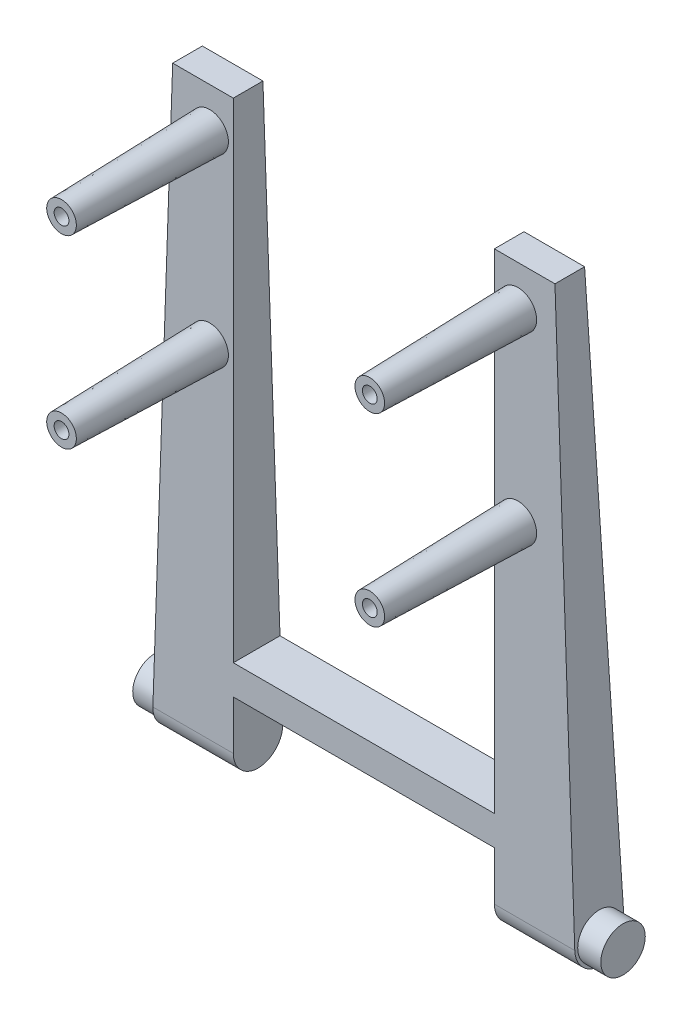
ISO-10303-21;
HEADER;
FILE_DESCRIPTION(('STEP AP214'),'2;1');
FILE_NAME('part.step','',(''),(''),'','','');
FILE_SCHEMA(('AUTOMOTIVE_DESIGN { 1 0 10303 214 1 1 1 1 }'));
ENDSEC;
DATA;
#1=APPLICATION_CONTEXT('core data for automotive mechanical design processes');
#2=APPLICATION_PROTOCOL_DEFINITION('international standard','automotive_design',2000,#1);
#3=PRODUCT_CONTEXT('',#1,'mechanical');
#4=PRODUCT('Part','Part','',(#3));
#5=PRODUCT_RELATED_PRODUCT_CATEGORY('part','',(#4));
#6=PRODUCT_DEFINITION_FORMATION('','',#4);
#7=PRODUCT_DEFINITION_CONTEXT('part definition',#1,'design');
#8=PRODUCT_DEFINITION('design','',#6,#7);
#9=PRODUCT_DEFINITION_SHAPE('','',#8);
#10=(LENGTH_UNIT() NAMED_UNIT(*) SI_UNIT(.MILLI.,.METRE.));
#11=(NAMED_UNIT(*) PLANE_ANGLE_UNIT() SI_UNIT($,.RADIAN.));
#12=(NAMED_UNIT(*) SI_UNIT($,.STERADIAN.) SOLID_ANGLE_UNIT());
#13=UNCERTAINTY_MEASURE_WITH_UNIT(LENGTH_MEASURE(1.E-05),#10,'distance_accuracy_value','');
#14=(GEOMETRIC_REPRESENTATION_CONTEXT(3) GLOBAL_UNCERTAINTY_ASSIGNED_CONTEXT((#13)) GLOBAL_UNIT_ASSIGNED_CONTEXT((#10,
#11,#12)) REPRESENTATION_CONTEXT('',''));
#15=CARTESIAN_POINT('',(0.,0.,0.));
#16=DIRECTION('',(0.,0.,1.));
#17=DIRECTION('',(1.,0.,0.));
#18=AXIS2_PLACEMENT_3D('',#15,#16,#17);
#19=CARTESIAN_POINT('',(-8.80937578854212,14.7347085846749,-24.1947583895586));
#20=DIRECTION('',(-1.,0.,0.));
#21=DIRECTION('',(0.,0.,1.));
#22=AXIS2_PLACEMENT_3D('',#19,#20,#21);
#23=PLANE('',#22);
#24=CARTESIAN_POINT('',(-8.80937578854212,19.95,-23.8947583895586));
#25=DIRECTION('',(-1.,0.,0.));
#26=DIRECTION('',(0.,0.,1.));
#27=AXIS2_PLACEMENT_3D('',#24,#25,#26);
#28=CIRCLE('',#27,1.7);
#29=CARTESIAN_POINT('',(-8.80937578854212,19.95,-22.1947583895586));
#30=VERTEX_POINT('',#29);
#31=CARTESIAN_POINT('',(-8.80937578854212,18.2502971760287,-23.8629730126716));
#32=VERTEX_POINT('',#31);
#33=EDGE_CURVE('E323',#30,#32,#28,.F.);
#34=ORIENTED_EDGE('',*,*,#33,.T.);
#35=CARTESIAN_POINT('',(-8.80937578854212,19.95,-23.8311876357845));
#36=DIRECTION('',(-1.,0.,0.));
#37=DIRECTION('',(0.,0.,1.));
#38=AXIS2_PLACEMENT_3D('',#35,#36,#37);
#39=CIRCLE('',#38,1.7);
#40=CARTESIAN_POINT('',(-8.80937578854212,20.0093291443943,-25.530152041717));
#41=VERTEX_POINT('',#40);
#42=EDGE_CURVE('E326',#32,#41,#39,.F.);
#43=ORIENTED_EDGE('',*,*,#42,.T.);
#44=DIRECTION('',(0.,0.999390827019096,0.034899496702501));
#45=VECTOR('',#44,1.);
#46=CARTESIAN_POINT('',(-8.80937578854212,58.25,-24.1947583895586));
#47=LINE('',#46,#45);
#48=CARTESIAN_POINT('',(-8.80937578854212,23.25,-25.4169853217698));
#49=VERTEX_POINT('',#48);
#50=EDGE_CURVE('E192',#49,#41,#47,.F.);
#51=ORIENTED_EDGE('',*,*,#50,.F.);
#52=DIRECTION('',(0.,0.,-1.));
#53=VECTOR('',#52,1.);
#54=CARTESIAN_POINT('',(-8.80937578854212,23.25,-22.1947583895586));
#55=LINE('',#54,#53);
#56=CARTESIAN_POINT('',(-8.80937578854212,23.25,-22.1947583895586));
#57=VERTEX_POINT('',#56);
#58=EDGE_CURVE('E167',#57,#49,#55,.T.);
#59=ORIENTED_EDGE('',*,*,#58,.F.);
#60=DIRECTION('',(0.,1.,0.));
#61=VECTOR('',#60,1.);
#62=CARTESIAN_POINT('',(-8.80937578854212,14.7347085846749,-22.1947583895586));
#63=LINE('',#62,#61);
#64=EDGE_CURVE('E149',#30,#57,#63,.T.);
#65=ORIENTED_EDGE('',*,*,#64,.F.);
#66=EDGE_LOOP('',(#34,#43,#51,#59,#65));
#67=FACE_BOUND('',#66,.T.);
#68=ADVANCED_FACE('F39',(#67),#23,.F.);
#69=DIRECTION('',(0.,0.,1.));
#70=VECTOR('',#69,1.);
#71=CARTESIAN_POINT('',(-8.80937578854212,25.2480319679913,-25.3472125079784));
#72=LINE('',#71,#70);
#73=CARTESIAN_POINT('',(-8.80937578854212,25.2480319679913,-25.3472125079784));
#74=VERTEX_POINT('',#73);
#75=CARTESIAN_POINT('',(-8.80937578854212,25.2480319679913,-22.1947583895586));
#76=VERTEX_POINT('',#75);
#77=EDGE_CURVE('E142',#74,#76,#72,.T.);
#78=ORIENTED_EDGE('',*,*,#77,.F.);
#79=CARTESIAN_POINT('',(-8.80937578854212,58.25,-24.1947583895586));
#80=VERTEX_POINT('',#79);
#81=EDGE_CURVE('E193',#80,#74,#47,.F.);
#82=ORIENTED_EDGE('',*,*,#81,.F.);
#83=DIRECTION('',(0.,0.,-1.));
#84=VECTOR('',#83,1.);
#85=CARTESIAN_POINT('',(-8.80937578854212,58.25,0.));
#86=LINE('',#85,#84);
#87=CARTESIAN_POINT('',(-8.80937578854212,58.25,-22.1947583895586));
#88=VERTEX_POINT('',#87);
#89=EDGE_CURVE('E145',#88,#80,#86,.T.);
#90=ORIENTED_EDGE('',*,*,#89,.F.);
#91=EDGE_CURVE('E138',#76,#88,#63,.T.);
#92=ORIENTED_EDGE('',*,*,#91,.F.);
#93=EDGE_LOOP('',(#78,#82,#90,#92));
#94=FACE_BOUND('',#93,.T.);
#95=ADVANCED_FACE('F140',(#94),#23,.F.);
#96=CARTESIAN_POINT('',(8.80937578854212,14.7347085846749,-24.1947583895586));
#97=DIRECTION('',(-1.,0.,0.));
#98=DIRECTION('',(0.,0.,1.));
#99=AXIS2_PLACEMENT_3D('',#96,#97,#98);
#100=PLANE('',#99);
#101=DIRECTION('',(0.,0.999390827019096,0.034899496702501));
#102=VECTOR('',#101,1.);
#103=CARTESIAN_POINT('',(8.80937578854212,58.25,-24.1947583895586));
#104=LINE('',#103,#102);
#105=CARTESIAN_POINT('',(8.80937578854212,20.0093291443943,-25.530152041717));
#106=VERTEX_POINT('',#105);
#107=CARTESIAN_POINT('',(8.80937578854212,23.25,-25.4169853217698));
#108=VERTEX_POINT('',#107);
#109=EDGE_CURVE('E150',#106,#108,#104,.T.);
#110=ORIENTED_EDGE('',*,*,#109,.F.);
#111=CARTESIAN_POINT('',(8.80937578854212,19.95,-23.8311876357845));
#112=DIRECTION('',(-1.,0.,0.));
#113=DIRECTION('',(0.,0.,1.));
#114=AXIS2_PLACEMENT_3D('',#111,#112,#113);
#115=CIRCLE('',#114,1.7);
#116=CARTESIAN_POINT('',(8.80937578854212,18.2502971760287,-23.8629730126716));
#117=VERTEX_POINT('',#116);
#118=EDGE_CURVE('E55',#106,#117,#115,.T.);
#119=ORIENTED_EDGE('',*,*,#118,.T.);
#120=CARTESIAN_POINT('',(8.80937578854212,19.95,-23.8947583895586));
#121=DIRECTION('',(-1.,0.,0.));
#122=DIRECTION('',(0.,0.,1.));
#123=AXIS2_PLACEMENT_3D('',#120,#121,#122);
#124=CIRCLE('',#123,1.7);
#125=CARTESIAN_POINT('',(8.80937578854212,19.95,-22.1947583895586));
#126=VERTEX_POINT('',#125);
#127=EDGE_CURVE('E59',#117,#126,#124,.T.);
#128=ORIENTED_EDGE('',*,*,#127,.T.);
#129=DIRECTION('',(0.,1.,0.));
#130=VECTOR('',#129,1.);
#131=CARTESIAN_POINT('',(8.80937578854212,14.7347085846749,-22.1947583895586));
#132=LINE('',#131,#130);
#133=CARTESIAN_POINT('',(8.80937578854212,23.25,-22.1947583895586));
#134=VERTEX_POINT('',#133);
#135=EDGE_CURVE('E185',#126,#134,#132,.T.);
#136=ORIENTED_EDGE('',*,*,#135,.T.);
#137=DIRECTION('',(0.,0.,-1.));
#138=VECTOR('',#137,1.);
#139=CARTESIAN_POINT('',(8.80937578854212,23.25,-24.1947583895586));
#140=LINE('',#139,#138);
#141=EDGE_CURVE('E305',#134,#108,#140,.T.);
#142=ORIENTED_EDGE('',*,*,#141,.T.);
#143=EDGE_LOOP('',(#110,#119,#128,#136,#142));
#144=FACE_BOUND('',#143,.T.);
#145=ADVANCED_FACE('F378',(#144),#100,.T.);
#146=CARTESIAN_POINT('',(8.80937578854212,25.2480319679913,-25.3472125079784));
#147=VERTEX_POINT('',#146);
#148=CARTESIAN_POINT('',(8.80937578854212,58.25,-24.1947583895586));
#149=VERTEX_POINT('',#148);
#150=EDGE_CURVE('E188',#147,#149,#104,.T.);
#151=ORIENTED_EDGE('',*,*,#150,.F.);
#152=DIRECTION('',(0.,0.,1.));
#153=VECTOR('',#152,1.);
#154=CARTESIAN_POINT('',(8.80937578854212,25.2480319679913,-24.1947583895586));
#155=LINE('',#154,#153);
#156=CARTESIAN_POINT('',(8.80937578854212,25.2480319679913,-22.1947583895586));
#157=VERTEX_POINT('',#156);
#158=EDGE_CURVE('E302',#147,#157,#155,.T.);
#159=ORIENTED_EDGE('',*,*,#158,.T.);
#160=CARTESIAN_POINT('',(8.80937578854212,58.25,-22.1947583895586));
#161=VERTEX_POINT('',#160);
#162=EDGE_CURVE('E157',#157,#161,#132,.T.);
#163=ORIENTED_EDGE('',*,*,#162,.T.);
#164=DIRECTION('',(0.,0.,-1.));
#165=VECTOR('',#164,1.);
#166=CARTESIAN_POINT('',(8.80937578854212,58.25,0.));
#167=LINE('',#166,#165);
#168=EDGE_CURVE('E298',#161,#149,#167,.T.);
#169=ORIENTED_EDGE('',*,*,#168,.T.);
#170=EDGE_LOOP('',(#151,#159,#163,#169));
#171=FACE_BOUND('',#170,.T.);
#172=ADVANCED_FACE('F396',(#171),#100,.T.);
#173=CARTESIAN_POINT('',(0.,58.25,0.));
#174=DIRECTION('',(0.,-1.,0.));
#175=DIRECTION('',(0.,0.,-1.));
#176=AXIS2_PLACEMENT_3D('',#173,#174,#175);
#177=PLANE('',#176);
#178=ORIENTED_EDGE('',*,*,#168,.F.);
#179=DIRECTION('',(-1.,0.,0.));
#180=VECTOR('',#179,1.);
#181=CARTESIAN_POINT('',(12.8992245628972,58.25,-22.1947583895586));
#182=LINE('',#181,#180);
#183=CARTESIAN_POINT('',(12.8992245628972,58.25,-22.1947583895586));
#184=VERTEX_POINT('',#183);
#185=EDGE_CURVE('E227',#184,#161,#182,.T.);
#186=ORIENTED_EDGE('',*,*,#185,.F.);
#187=DIRECTION('',(0.,0.,1.));
#188=VECTOR('',#187,1.);
#189=CARTESIAN_POINT('',(12.8992245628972,58.25,-22.1947583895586));
#190=LINE('',#189,#188);
#191=CARTESIAN_POINT('',(12.8992245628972,58.25,-24.1947583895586));
#192=VERTEX_POINT('',#191);
#193=EDGE_CURVE('E220',#192,#184,#190,.T.);
#194=ORIENTED_EDGE('',*,*,#193,.F.);
#195=DIRECTION('',(1.,0.,0.));
#196=VECTOR('',#195,1.);
#197=CARTESIAN_POINT('',(12.8992245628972,58.25,-24.1947583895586));
#198=LINE('',#197,#196);
#199=EDGE_CURVE('E224',#149,#192,#198,.T.);
#200=ORIENTED_EDGE('',*,*,#199,.F.);
#201=EDGE_LOOP('',(#178,#186,#194,#200));
#202=FACE_BOUND('',#201,.T.);
#203=ADVANCED_FACE('F400',(#202),#177,.F.);
#204=CARTESIAN_POINT('',(-12.8992245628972,58.25,-22.1947583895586));
#205=DIRECTION('',(0.,0.,-1.));
#206=DIRECTION('',(-1.,0.,0.));
#207=AXIS2_PLACEMENT_3D('',#204,#205,#206);
#208=PLANE('',#207);
#209=ORIENTED_EDGE('',*,*,#135,.F.);
#210=DIRECTION('',(-1.,0.,0.));
#211=VECTOR('',#210,1.);
#212=CARTESIAN_POINT('',(-12.8992245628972,19.95,-22.1947583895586));
#213=LINE('',#212,#211);
#214=CARTESIAN_POINT('',(14.2366900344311,19.95,-22.1947583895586));
#215=VERTEX_POINT('',#214);
#216=EDGE_CURVE('E342',#126,#215,#213,.F.);
#217=ORIENTED_EDGE('',*,*,#216,.T.);
#218=DIRECTION('',(0.034899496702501,-0.999390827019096,0.));
#219=VECTOR('',#218,1.);
#220=CARTESIAN_POINT('',(12.8992245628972,58.25,-22.1947583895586));
#221=LINE('',#220,#219);
#222=EDGE_CURVE('E230',#184,#215,#221,.T.);
#223=ORIENTED_EDGE('',*,*,#222,.F.);
#224=ORIENTED_EDGE('',*,*,#185,.T.);
#225=ORIENTED_EDGE('',*,*,#162,.F.);
#226=DIRECTION('',(-1.,0.,0.));
#227=VECTOR('',#226,1.);
#228=CARTESIAN_POINT('',(9.19062421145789,25.2480319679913,-22.1947583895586));
#229=LINE('',#228,#227);
#230=EDGE_CURVE('E153',#157,#76,#229,.T.);
#231=ORIENTED_EDGE('',*,*,#230,.T.);
#232=ORIENTED_EDGE('',*,*,#91,.T.);
#233=DIRECTION('',(1.,0.,0.));
#234=VECTOR('',#233,1.);
#235=CARTESIAN_POINT('',(-12.8992245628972,58.25,-22.1947583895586));
#236=LINE('',#235,#234);
#237=CARTESIAN_POINT('',(-12.8992245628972,58.25,-22.1947583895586));
#238=VERTEX_POINT('',#237);
#239=EDGE_CURVE('E260',#238,#88,#236,.T.);
#240=ORIENTED_EDGE('',*,*,#239,.F.);
#241=DIRECTION('',(0.034899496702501,0.999390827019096,0.));
#242=VECTOR('',#241,1.);
#243=CARTESIAN_POINT('',(-12.8992245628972,58.25,-22.1947583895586));
#244=LINE('',#243,#242);
#245=CARTESIAN_POINT('',(-14.2366900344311,19.95,-22.1947583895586));
#246=VERTEX_POINT('',#245);
#247=EDGE_CURVE('E270',#238,#246,#244,.F.);
#248=ORIENTED_EDGE('',*,*,#247,.T.);
#249=DIRECTION('',(1.,0.,0.));
#250=VECTOR('',#249,1.);
#251=CARTESIAN_POINT('',(-12.8992245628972,19.95,-22.1947583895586));
#252=LINE('',#251,#250);
#253=EDGE_CURVE('E339',#246,#30,#252,.T.);
#254=ORIENTED_EDGE('',*,*,#253,.T.);
#255=ORIENTED_EDGE('',*,*,#64,.T.);
#256=DIRECTION('',(-1.,0.,0.));
#257=VECTOR('',#256,1.);
#258=CARTESIAN_POINT('',(9.19062421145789,23.25,-22.1947583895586));
#259=LINE('',#258,#257);
#260=EDGE_CURVE('E181',#134,#57,#259,.T.);
#261=ORIENTED_EDGE('',*,*,#260,.F.);
#262=EDGE_LOOP('',(#209,#217,#223,#224,#225,#231,#232,#240,#248,#254,#255,#261));
#263=FACE_BOUND('',#262,.T.);
#264=CARTESIAN_POINT('',(-10.4018583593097,43.05,-22.1947583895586));
#265=DIRECTION('',(0.,0.,-1.));
#266=DIRECTION('',(-1.,0.,0.));
#267=AXIS2_PLACEMENT_3D('',#264,#265,#266);
#268=CIRCLE('',#267,1.26185921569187);
#269=CARTESIAN_POINT('',(-11.6637175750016,43.05,-22.1947583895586));
#270=VERTEX_POINT('',#269);
#271=EDGE_CURVE('E284',#270,#270,#268,.F.);
#272=ORIENTED_EDGE('',*,*,#271,.F.);
#273=EDGE_LOOP('',(#272));
#274=FACE_BOUND('',#273,.T.);
#275=CARTESIAN_POINT('',(-10.4018583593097,55.5248466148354,-22.1947583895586));
#276=DIRECTION('',(0.,0.,-1.));
#277=DIRECTION('',(-1.,0.,0.));
#278=AXIS2_PLACEMENT_3D('',#275,#276,#277);
#279=CIRCLE('',#278,1.26185921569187);
#280=CARTESIAN_POINT('',(-11.6637175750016,55.5248466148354,-22.1947583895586));
#281=VERTEX_POINT('',#280);
#282=EDGE_CURVE('E274',#281,#281,#279,.F.);
#283=ORIENTED_EDGE('',*,*,#282,.F.);
#284=EDGE_LOOP('',(#283));
#285=FACE_BOUND('',#284,.T.);
#286=CARTESIAN_POINT('',(10.4018583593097,43.05,-22.1947583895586));
#287=DIRECTION('',(0.,0.,1.));
#288=DIRECTION('',(1.,0.,0.));
#289=AXIS2_PLACEMENT_3D('',#286,#287,#288);
#290=CIRCLE('',#289,1.26185921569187);
#291=CARTESIAN_POINT('',(11.6637175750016,43.05,-22.1947583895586));
#292=VERTEX_POINT('',#291);
#293=EDGE_CURVE('E289',#292,#292,#290,.T.);
#294=ORIENTED_EDGE('',*,*,#293,.F.);
#295=EDGE_LOOP('',(#294));
#296=FACE_BOUND('',#295,.T.);
#297=CARTESIAN_POINT('',(10.4018583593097,55.5248466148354,-22.1947583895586));
#298=DIRECTION('',(0.,0.,1.));
#299=DIRECTION('',(1.,0.,0.));
#300=AXIS2_PLACEMENT_3D('',#297,#298,#299);
#301=CIRCLE('',#300,1.26185921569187);
#302=CARTESIAN_POINT('',(11.6637175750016,55.5248466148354,-22.1947583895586));
#303=VERTEX_POINT('',#302);
#304=EDGE_CURVE('E285',#303,#303,#301,.T.);
#305=ORIENTED_EDGE('',*,*,#304,.F.);
#306=EDGE_LOOP('',(#305));
#307=FACE_BOUND('',#306,.T.);
#308=ADVANCED_FACE('F154',(#263,#274,#285,#296,#307),#208,.F.);
#309=CARTESIAN_POINT('',(-12.8992245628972,58.25,-24.1947583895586));
#310=DIRECTION('',(0.,0.034899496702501,-0.999390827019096));
#311=DIRECTION('',(0.,0.999390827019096,0.034899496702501));
#312=AXIS2_PLACEMENT_3D('',#309,#310,#311);
#313=PLANE('',#312);
#314=ORIENTED_EDGE('',*,*,#50,.T.);
#315=DIRECTION('',(-1.,0.,0.));
#316=VECTOR('',#315,1.);
#317=CARTESIAN_POINT('',(-12.8992245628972,20.0093291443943,-25.530152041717));
#318=LINE('',#317,#316);
#319=CARTESIAN_POINT('',(-14.2346182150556,20.0093291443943,-25.530152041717));
#320=VERTEX_POINT('',#319);
#321=EDGE_CURVE('E313',#41,#320,#318,.T.);
#322=ORIENTED_EDGE('',*,*,#321,.T.);
#323=DIRECTION('',(-0.0348782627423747,-0.998782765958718,-0.0348782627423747));
#324=VECTOR('',#323,1.);
#325=CARTESIAN_POINT('',(-12.8967915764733,58.3196716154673,-24.1923254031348));
#326=LINE('',#325,#324);
#327=CARTESIAN_POINT('',(-12.8992245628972,58.25,-24.1947583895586));
#328=VERTEX_POINT('',#327);
#329=EDGE_CURVE('E266',#328,#320,#326,.T.);
#330=ORIENTED_EDGE('',*,*,#329,.F.);
#331=DIRECTION('',(-1.,0.,0.));
#332=VECTOR('',#331,1.);
#333=CARTESIAN_POINT('',(-12.8992245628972,58.25,-24.1947583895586));
#334=LINE('',#333,#332);
#335=EDGE_CURVE('E263',#80,#328,#334,.T.);
#336=ORIENTED_EDGE('',*,*,#335,.F.);
#337=ORIENTED_EDGE('',*,*,#81,.T.);
#338=DIRECTION('',(-1.,0.,0.));
#339=VECTOR('',#338,1.);
#340=CARTESIAN_POINT('',(9.19062421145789,25.2480319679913,-25.3472125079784));
#341=LINE('',#340,#339);
#342=EDGE_CURVE('E161',#147,#74,#341,.T.);
#343=ORIENTED_EDGE('',*,*,#342,.F.);
#344=ORIENTED_EDGE('',*,*,#150,.T.);
#345=ORIENTED_EDGE('',*,*,#199,.T.);
#346=DIRECTION('',(0.0348782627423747,-0.998782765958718,-0.0348782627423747));
#347=VECTOR('',#346,1.);
#348=CARTESIAN_POINT('',(12.8992245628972,58.25,-24.1947583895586));
#349=LINE('',#348,#347);
#350=CARTESIAN_POINT('',(14.2346182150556,20.0093291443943,-25.530152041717));
#351=VERTEX_POINT('',#350);
#352=EDGE_CURVE('E248',#192,#351,#349,.T.);
#353=ORIENTED_EDGE('',*,*,#352,.T.);
#354=DIRECTION('',(1.,0.,0.));
#355=VECTOR('',#354,1.);
#356=CARTESIAN_POINT('',(-12.8992245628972,20.0093291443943,-25.530152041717));
#357=LINE('',#356,#355);
#358=EDGE_CURVE('E309',#351,#106,#357,.F.);
#359=ORIENTED_EDGE('',*,*,#358,.T.);
#360=ORIENTED_EDGE('',*,*,#109,.T.);
#361=DIRECTION('',(-1.,0.,0.));
#362=VECTOR('',#361,1.);
#363=CARTESIAN_POINT('',(9.19062421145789,23.25,-25.4169853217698));
#364=LINE('',#363,#362);
#365=EDGE_CURVE('E177',#108,#49,#364,.T.);
#366=ORIENTED_EDGE('',*,*,#365,.T.);
#367=EDGE_LOOP('',(#314,#322,#330,#336,#337,#343,#344,#345,#353,#359,#360,#366));
#368=FACE_BOUND('',#367,.T.);
#369=ADVANCED_FACE('F376',(#368),#313,.T.);
#370=CARTESIAN_POINT('',(-12.8992245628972,58.25,-22.1947583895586));
#371=DIRECTION('',(-0.999390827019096,0.034899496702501,0.));
#372=DIRECTION('',(-0.034899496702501,-0.999390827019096,0.));
#373=AXIS2_PLACEMENT_3D('',#370,#371,#372);
#374=PLANE('',#373);
#375=CARTESIAN_POINT('',(-14.2366900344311,19.95,-23.8931737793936));
#376=DIRECTION('',(-0.999390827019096,0.034899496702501,0.));
#377=DIRECTION('',(-0.034899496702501,-0.999390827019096,0.));
#378=AXIS2_PLACEMENT_3D('',#375,#376,#377);
#379=ELLIPSE('',#378,1.50035643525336,1.49944245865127);
#380=CARTESIAN_POINT('',(-14.2890517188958,18.4505575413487,-23.8931737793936));
#381=VERTEX_POINT('',#380);
#382=EDGE_CURVE('E11',#381,#381,#379,.T.);
#383=ORIENTED_EDGE('',*,*,#382,.F.);
#384=EDGE_LOOP('',(#383));
#385=FACE_BOUND('',#384,.T.);
#386=ORIENTED_EDGE('',*,*,#329,.T.);
#387=CARTESIAN_POINT('',(-14.2366900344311,19.95,-23.8311876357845));
#388=DIRECTION('',(-0.999390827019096,0.034899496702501,0.));
#389=DIRECTION('',(0.034899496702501,0.999390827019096,0.));
#390=AXIS2_PLACEMENT_3D('',#387,#388,#389);
#391=ELLIPSE('',#390,1.701036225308,1.7);
#392=CARTESIAN_POINT('',(-14.2960449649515,18.2502971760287,-23.8629730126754));
#393=VERTEX_POINT('',#392);
#394=EDGE_CURVE('E320',#320,#393,#391,.T.);
#395=ORIENTED_EDGE('',*,*,#394,.T.);
#396=CARTESIAN_POINT('',(-14.2366900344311,19.95,-23.8947583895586));
#397=DIRECTION('',(-0.999390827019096,0.034899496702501,0.));
#398=DIRECTION('',(0.034899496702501,0.999390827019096,0.));
#399=AXIS2_PLACEMENT_3D('',#396,#397,#398);
#400=ELLIPSE('',#399,1.701036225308,1.7);
#401=EDGE_CURVE('E317',#393,#246,#400,.T.);
#402=ORIENTED_EDGE('',*,*,#401,.T.);
#403=ORIENTED_EDGE('',*,*,#247,.F.);
#404=DIRECTION('',(0.,0.,1.));
#405=VECTOR('',#404,1.);
#406=CARTESIAN_POINT('',(-12.8992245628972,58.25,-22.1947583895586));
#407=LINE('',#406,#405);
#408=EDGE_CURVE('E256',#328,#238,#407,.T.);
#409=ORIENTED_EDGE('',*,*,#408,.F.);
#410=EDGE_LOOP('',(#386,#395,#402,#403,#409));
#411=FACE_BOUND('',#410,.T.);
#412=ADVANCED_FACE('F415',(#385,#411),#374,.T.);
#413=CARTESIAN_POINT('',(0.,58.25,0.));
#414=DIRECTION('',(0.,-1.,0.));
#415=DIRECTION('',(0.,0.,-1.));
#416=AXIS2_PLACEMENT_3D('',#413,#414,#415);
#417=PLANE('',#416);
#418=ORIENTED_EDGE('',*,*,#239,.T.);
#419=ORIENTED_EDGE('',*,*,#89,.T.);
#420=ORIENTED_EDGE('',*,*,#335,.T.);
#421=ORIENTED_EDGE('',*,*,#408,.T.);
#422=EDGE_LOOP('',(#418,#419,#420,#421));
#423=FACE_BOUND('',#422,.T.);
#424=ADVANCED_FACE('F405',(#423),#417,.F.);
#425=CARTESIAN_POINT('',(-10.4018583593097,55.5248466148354,-12.1947583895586));
#426=DIRECTION('',(0.,0.,-1.));
#427=DIRECTION('',(1.,0.,0.));
#428=AXIS2_PLACEMENT_3D('',#425,#426,#427);
#429=CONICAL_SURFACE('',#428,1.,0.026179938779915);
#430=CARTESIAN_POINT('',(-10.4018583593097,55.5248466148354,-12.1947583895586));
#431=DIRECTION('',(0.,0.,1.));
#432=DIRECTION('',(1.,0.,0.));
#433=AXIS2_PLACEMENT_3D('',#430,#431,#432);
#434=CIRCLE('',#433,1.);
#435=CARTESIAN_POINT('',(-9.40185835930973,55.5248466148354,-12.1947583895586));
#436=VERTEX_POINT('',#435);
#437=EDGE_CURVE('E252',#436,#436,#434,.T.);
#438=ORIENTED_EDGE('',*,*,#437,.F.);
#439=EDGE_LOOP('',(#438));
#440=FACE_BOUND('',#439,.T.);
#441=ORIENTED_EDGE('',*,*,#282,.T.);
#442=EDGE_LOOP('',(#441));
#443=FACE_BOUND('',#442,.T.);
#444=ADVANCED_FACE('F424',(#440,#443),#429,.T.);
#445=CARTESIAN_POINT('',(-10.4018583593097,55.5248466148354,-12.1947583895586));
#446=DIRECTION('',(0.,0.,1.));
#447=DIRECTION('',(1.,0.,0.));
#448=AXIS2_PLACEMENT_3D('',#445,#446,#447);
#449=PLANE('',#448);
#450=CARTESIAN_POINT('',(-10.4018583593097,55.5248466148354,-12.1947583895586));
#451=DIRECTION('',(0.,0.,1.));
#452=DIRECTION('',(1.,0.,0.));
#453=AXIS2_PLACEMENT_3D('',#450,#451,#452);
#454=CIRCLE('',#453,0.500000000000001);
#455=CARTESIAN_POINT('',(-9.90185835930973,55.5248466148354,-12.1947583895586));
#456=VERTEX_POINT('',#455);
#457=EDGE_CURVE('E236',#456,#456,#454,.T.);
#458=ORIENTED_EDGE('',*,*,#457,.F.);
#459=EDGE_LOOP('',(#458));
#460=FACE_BOUND('',#459,.T.);
#461=ORIENTED_EDGE('',*,*,#437,.T.);
#462=EDGE_LOOP('',(#461));
#463=FACE_BOUND('',#462,.T.);
#464=ADVANCED_FACE('F486',(#460,#463),#449,.T.);
#465=CARTESIAN_POINT('',(-10.4018583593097,43.05,-12.1947583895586));
#466=DIRECTION('',(0.,0.,-1.));
#467=DIRECTION('',(1.,0.,0.));
#468=AXIS2_PLACEMENT_3D('',#465,#466,#467);
#469=CONICAL_SURFACE('',#468,1.,0.026179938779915);
#470=CARTESIAN_POINT('',(-10.4018583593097,43.05,-12.1947583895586));
#471=DIRECTION('',(0.,0.,1.));
#472=DIRECTION('',(1.,0.,0.));
#473=AXIS2_PLACEMENT_3D('',#470,#471,#472);
#474=CIRCLE('',#473,1.);
#475=CARTESIAN_POINT('',(-9.40185835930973,43.05,-12.1947583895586));
#476=VERTEX_POINT('',#475);
#477=EDGE_CURVE('E235',#476,#476,#474,.T.);
#478=ORIENTED_EDGE('',*,*,#477,.F.);
#479=EDGE_LOOP('',(#478));
#480=FACE_BOUND('',#479,.T.);
#481=ORIENTED_EDGE('',*,*,#271,.T.);
#482=EDGE_LOOP('',(#481));
#483=FACE_BOUND('',#482,.T.);
#484=ADVANCED_FACE('F484',(#480,#483),#469,.T.);
#485=CARTESIAN_POINT('',(-10.4018583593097,43.05,-12.1947583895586));
#486=DIRECTION('',(0.,0.,1.));
#487=DIRECTION('',(1.,0.,0.));
#488=AXIS2_PLACEMENT_3D('',#485,#486,#487);
#489=PLANE('',#488);
#490=CARTESIAN_POINT('',(-10.4018583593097,43.05,-12.1947583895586));
#491=DIRECTION('',(0.,0.,1.));
#492=DIRECTION('',(1.,0.,0.));
#493=AXIS2_PLACEMENT_3D('',#490,#491,#492);
#494=CIRCLE('',#493,0.500000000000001);
#495=CARTESIAN_POINT('',(-9.90185835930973,43.05,-12.1947583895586));
#496=VERTEX_POINT('',#495);
#497=EDGE_CURVE('E244',#496,#496,#494,.T.);
#498=ORIENTED_EDGE('',*,*,#497,.F.);
#499=EDGE_LOOP('',(#498));
#500=FACE_BOUND('',#499,.T.);
#501=ORIENTED_EDGE('',*,*,#477,.T.);
#502=EDGE_LOOP('',(#501));
#503=FACE_BOUND('',#502,.T.);
#504=ADVANCED_FACE('F480',(#500,#503),#489,.T.);
#505=CARTESIAN_POINT('',(-10.4018583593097,43.05,-17.1947583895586));
#506=DIRECTION('',(0.,0.,1.));
#507=DIRECTION('',(1.,0.,0.));
#508=AXIS2_PLACEMENT_3D('',#505,#506,#507);
#509=CYLINDRICAL_SURFACE('',#508,0.500000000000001);
#510=CARTESIAN_POINT('',(-10.4018583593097,43.05,-17.1947583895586));
#511=DIRECTION('',(0.,0.,1.));
#512=DIRECTION('',(1.,0.,0.));
#513=AXIS2_PLACEMENT_3D('',#510,#511,#512);
#514=CIRCLE('',#513,0.500000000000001);
#515=CARTESIAN_POINT('',(-9.90185835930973,43.05,-17.1947583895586));
#516=VERTEX_POINT('',#515);
#517=EDGE_CURVE('E240',#516,#516,#514,.T.);
#518=ORIENTED_EDGE('',*,*,#517,.F.);
#519=EDGE_LOOP('',(#518));
#520=FACE_BOUND('',#519,.T.);
#521=ORIENTED_EDGE('',*,*,#497,.T.);
#522=EDGE_LOOP('',(#521));
#523=FACE_BOUND('',#522,.T.);
#524=ADVANCED_FACE('F476',(#520,#523),#509,.F.);
#525=CARTESIAN_POINT('',(-10.4018583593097,43.05,-17.1947583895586));
#526=DIRECTION('',(0.,0.,1.));
#527=DIRECTION('',(1.,0.,0.));
#528=AXIS2_PLACEMENT_3D('',#525,#526,#527);
#529=PLANE('',#528);
#530=ORIENTED_EDGE('',*,*,#517,.T.);
#531=EDGE_LOOP('',(#530));
#532=FACE_BOUND('',#531,.T.);
#533=ADVANCED_FACE('F472',(#532),#529,.T.);
#534=CARTESIAN_POINT('',(-10.4018583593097,55.5248466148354,-17.1947583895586));
#535=DIRECTION('',(0.,0.,1.));
#536=DIRECTION('',(1.,0.,0.));
#537=AXIS2_PLACEMENT_3D('',#534,#535,#536);
#538=CYLINDRICAL_SURFACE('',#537,0.500000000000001);
#539=CARTESIAN_POINT('',(-10.4018583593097,55.5248466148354,-17.1947583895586));
#540=DIRECTION('',(0.,0.,1.));
#541=DIRECTION('',(1.,0.,0.));
#542=AXIS2_PLACEMENT_3D('',#539,#540,#541);
#543=CIRCLE('',#542,0.500000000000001);
#544=CARTESIAN_POINT('',(-9.90185835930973,55.5248466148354,-17.1947583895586));
#545=VERTEX_POINT('',#544);
#546=EDGE_CURVE('E231',#545,#545,#543,.T.);
#547=ORIENTED_EDGE('',*,*,#546,.F.);
#548=EDGE_LOOP('',(#547));
#549=FACE_BOUND('',#548,.T.);
#550=ORIENTED_EDGE('',*,*,#457,.T.);
#551=EDGE_LOOP('',(#550));
#552=FACE_BOUND('',#551,.T.);
#553=ADVANCED_FACE('F468',(#549,#552),#538,.F.);
#554=CARTESIAN_POINT('',(-10.4018583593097,55.5248466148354,-17.1947583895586));
#555=DIRECTION('',(0.,0.,1.));
#556=DIRECTION('',(1.,0.,0.));
#557=AXIS2_PLACEMENT_3D('',#554,#555,#556);
#558=PLANE('',#557);
#559=ORIENTED_EDGE('',*,*,#546,.T.);
#560=EDGE_LOOP('',(#559));
#561=FACE_BOUND('',#560,.T.);
#562=ADVANCED_FACE('F363',(#561),#558,.T.);
#563=CARTESIAN_POINT('',(12.8992245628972,58.25,-22.1947583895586));
#564=DIRECTION('',(0.999390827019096,0.034899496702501,0.));
#565=DIRECTION('',(-0.034899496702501,0.999390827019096,0.));
#566=AXIS2_PLACEMENT_3D('',#563,#564,#565);
#567=PLANE('',#566);
#568=CARTESIAN_POINT('',(14.2366900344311,19.95,-23.8931737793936));
#569=DIRECTION('',(0.999390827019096,0.034899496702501,0.));
#570=DIRECTION('',(0.034899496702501,-0.999390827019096,0.));
#571=AXIS2_PLACEMENT_3D('',#568,#569,#570);
#572=ELLIPSE('',#571,1.50035643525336,1.49944245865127);
#573=CARTESIAN_POINT('',(14.2890517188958,18.4505575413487,-23.8931737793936));
#574=VERTEX_POINT('',#573);
#575=EDGE_CURVE('E48',#574,#574,#572,.T.);
#576=ORIENTED_EDGE('',*,*,#575,.F.);
#577=EDGE_LOOP('',(#576));
#578=FACE_BOUND('',#577,.T.);
#579=CARTESIAN_POINT('',(14.2366900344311,19.95,-23.8947583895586));
#580=DIRECTION('',(0.999390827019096,0.034899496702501,0.));
#581=DIRECTION('',(-0.034899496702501,0.999390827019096,0.));
#582=AXIS2_PLACEMENT_3D('',#579,#580,#581);
#583=ELLIPSE('',#582,1.701036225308,1.7);
#584=CARTESIAN_POINT('',(14.2960449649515,18.2502971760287,-23.8629730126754));
#585=VERTEX_POINT('',#584);
#586=EDGE_CURVE('E329',#215,#585,#583,.T.);
#587=ORIENTED_EDGE('',*,*,#586,.T.);
#588=CARTESIAN_POINT('',(14.2366900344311,19.95,-23.8311876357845));
#589=DIRECTION('',(0.999390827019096,0.034899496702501,0.));
#590=DIRECTION('',(-0.034899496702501,0.999390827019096,0.));
#591=AXIS2_PLACEMENT_3D('',#588,#589,#590);
#592=ELLIPSE('',#591,1.701036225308,1.7);
#593=EDGE_CURVE('E332',#585,#351,#592,.T.);
#594=ORIENTED_EDGE('',*,*,#593,.T.);
#595=ORIENTED_EDGE('',*,*,#352,.F.);
#596=ORIENTED_EDGE('',*,*,#193,.T.);
#597=ORIENTED_EDGE('',*,*,#222,.T.);
#598=EDGE_LOOP('',(#587,#594,#595,#596,#597));
#599=FACE_BOUND('',#598,.T.);
#600=ADVANCED_FACE('F359',(#578,#599),#567,.T.);
#601=CARTESIAN_POINT('',(10.4018583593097,55.5248466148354,-12.1947583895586));
#602=DIRECTION('',(0.,0.,-1.));
#603=DIRECTION('',(-1.,0.,0.));
#604=AXIS2_PLACEMENT_3D('',#601,#602,#603);
#605=CONICAL_SURFACE('',#604,1.,0.026179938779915);
#606=CARTESIAN_POINT('',(10.4018583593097,55.5248466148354,-12.1947583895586));
#607=DIRECTION('',(0.,0.,-1.));
#608=DIRECTION('',(-1.,0.,0.));
#609=AXIS2_PLACEMENT_3D('',#606,#607,#608);
#610=CIRCLE('',#609,1.);
#611=CARTESIAN_POINT('',(9.40185835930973,55.5248466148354,-12.1947583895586));
#612=VERTEX_POINT('',#611);
#613=EDGE_CURVE('E216',#612,#612,#610,.T.);
#614=ORIENTED_EDGE('',*,*,#613,.T.);
#615=EDGE_LOOP('',(#614));
#616=FACE_BOUND('',#615,.T.);
#617=ORIENTED_EDGE('',*,*,#304,.T.);
#618=EDGE_LOOP('',(#617));
#619=FACE_BOUND('',#618,.T.);
#620=ADVANCED_FACE('F362',(#616,#619),#605,.T.);
#621=CARTESIAN_POINT('',(10.4018583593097,55.5248466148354,-12.1947583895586));
#622=DIRECTION('',(0.,0.,1.));
#623=DIRECTION('',(-1.,0.,0.));
#624=AXIS2_PLACEMENT_3D('',#621,#622,#623);
#625=PLANE('',#624);
#626=CARTESIAN_POINT('',(10.4018583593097,55.5248466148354,-12.1947583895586));
#627=DIRECTION('',(0.,0.,-1.));
#628=DIRECTION('',(-1.,0.,0.));
#629=AXIS2_PLACEMENT_3D('',#626,#627,#628);
#630=CIRCLE('',#629,0.500000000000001);
#631=CARTESIAN_POINT('',(9.90185835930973,55.5248466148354,-12.1947583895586));
#632=VERTEX_POINT('',#631);
#633=EDGE_CURVE('E202',#632,#632,#630,.T.);
#634=ORIENTED_EDGE('',*,*,#633,.T.);
#635=EDGE_LOOP('',(#634));
#636=FACE_BOUND('',#635,.T.);
#637=ORIENTED_EDGE('',*,*,#613,.F.);
#638=EDGE_LOOP('',(#637));
#639=FACE_BOUND('',#638,.T.);
#640=ADVANCED_FACE('F460',(#636,#639),#625,.T.);
#641=CARTESIAN_POINT('',(10.4018583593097,43.05,-12.1947583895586));
#642=DIRECTION('',(0.,0.,-1.));
#643=DIRECTION('',(-1.,0.,0.));
#644=AXIS2_PLACEMENT_3D('',#641,#642,#643);
#645=CONICAL_SURFACE('',#644,1.,0.026179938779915);
#646=CARTESIAN_POINT('',(10.4018583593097,43.05,-12.1947583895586));
#647=DIRECTION('',(0.,0.,-1.));
#648=DIRECTION('',(-1.,0.,0.));
#649=AXIS2_PLACEMENT_3D('',#646,#647,#648);
#650=CIRCLE('',#649,1.);
#651=CARTESIAN_POINT('',(9.40185835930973,43.05,-12.1947583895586));
#652=VERTEX_POINT('',#651);
#653=EDGE_CURVE('E201',#652,#652,#650,.T.);
#654=ORIENTED_EDGE('',*,*,#653,.T.);
#655=EDGE_LOOP('',(#654));
#656=FACE_BOUND('',#655,.T.);
#657=ORIENTED_EDGE('',*,*,#293,.T.);
#658=EDGE_LOOP('',(#657));
#659=FACE_BOUND('',#658,.T.);
#660=ADVANCED_FACE('F458',(#656,#659),#645,.T.);
#661=CARTESIAN_POINT('',(10.4018583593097,43.05,-12.1947583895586));
#662=DIRECTION('',(0.,0.,1.));
#663=DIRECTION('',(-1.,0.,0.));
#664=AXIS2_PLACEMENT_3D('',#661,#662,#663);
#665=PLANE('',#664);
#666=CARTESIAN_POINT('',(10.4018583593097,43.05,-12.1947583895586));
#667=DIRECTION('',(0.,0.,-1.));
#668=DIRECTION('',(-1.,0.,0.));
#669=AXIS2_PLACEMENT_3D('',#666,#667,#668);
#670=CIRCLE('',#669,0.500000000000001);
#671=CARTESIAN_POINT('',(9.90185835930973,43.05,-12.1947583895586));
#672=VERTEX_POINT('',#671);
#673=EDGE_CURVE('E196',#672,#672,#670,.T.);
#674=ORIENTED_EDGE('',*,*,#673,.T.);
#675=EDGE_LOOP('',(#674));
#676=FACE_BOUND('',#675,.T.);
#677=ORIENTED_EDGE('',*,*,#653,.F.);
#678=EDGE_LOOP('',(#677));
#679=FACE_BOUND('',#678,.T.);
#680=ADVANCED_FACE('F454',(#676,#679),#665,.T.);
#681=CARTESIAN_POINT('',(10.4018583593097,43.05,-17.1947583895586));
#682=DIRECTION('',(0.,0.,1.));
#683=DIRECTION('',(1.,0.,0.));
#684=AXIS2_PLACEMENT_3D('',#681,#682,#683);
#685=CYLINDRICAL_SURFACE('',#684,0.500000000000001);
#686=CARTESIAN_POINT('',(10.4018583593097,43.05,-17.1947583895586));
#687=DIRECTION('',(0.,0.,-1.));
#688=DIRECTION('',(-1.,0.,0.));
#689=AXIS2_PLACEMENT_3D('',#686,#687,#688);
#690=CIRCLE('',#689,0.500000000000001);
#691=CARTESIAN_POINT('',(9.90185835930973,43.05,-17.1947583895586));
#692=VERTEX_POINT('',#691);
#693=EDGE_CURVE('E206',#692,#692,#690,.T.);
#694=ORIENTED_EDGE('',*,*,#693,.T.);
#695=EDGE_LOOP('',(#694));
#696=FACE_BOUND('',#695,.T.);
#697=ORIENTED_EDGE('',*,*,#673,.F.);
#698=EDGE_LOOP('',(#697));
#699=FACE_BOUND('',#698,.T.);
#700=ADVANCED_FACE('F450',(#696,#699),#685,.F.);
#701=CARTESIAN_POINT('',(10.4018583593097,43.05,-17.1947583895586));
#702=DIRECTION('',(0.,0.,1.));
#703=DIRECTION('',(-1.,0.,0.));
#704=AXIS2_PLACEMENT_3D('',#701,#702,#703);
#705=PLANE('',#704);
#706=ORIENTED_EDGE('',*,*,#693,.F.);
#707=EDGE_LOOP('',(#706));
#708=FACE_BOUND('',#707,.T.);
#709=ADVANCED_FACE('F446',(#708),#705,.T.);
#710=CARTESIAN_POINT('',(10.4018583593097,55.5248466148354,-17.1947583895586));
#711=DIRECTION('',(0.,0.,1.));
#712=DIRECTION('',(1.,0.,0.));
#713=AXIS2_PLACEMENT_3D('',#710,#711,#712);
#714=CYLINDRICAL_SURFACE('',#713,0.500000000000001);
#715=CARTESIAN_POINT('',(10.4018583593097,55.5248466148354,-17.1947583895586));
#716=DIRECTION('',(0.,0.,-1.));
#717=DIRECTION('',(-1.,0.,0.));
#718=AXIS2_PLACEMENT_3D('',#715,#716,#717);
#719=CIRCLE('',#718,0.500000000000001);
#720=CARTESIAN_POINT('',(9.90185835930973,55.5248466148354,-17.1947583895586));
#721=VERTEX_POINT('',#720);
#722=EDGE_CURVE('E197',#721,#721,#719,.T.);
#723=ORIENTED_EDGE('',*,*,#722,.T.);
#724=EDGE_LOOP('',(#723));
#725=FACE_BOUND('',#724,.T.);
#726=ORIENTED_EDGE('',*,*,#633,.F.);
#727=EDGE_LOOP('',(#726));
#728=FACE_BOUND('',#727,.T.);
#729=ADVANCED_FACE('F442',(#725,#728),#714,.F.);
#730=CARTESIAN_POINT('',(10.4018583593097,55.5248466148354,-17.1947583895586));
#731=DIRECTION('',(0.,0.,1.));
#732=DIRECTION('',(-1.,0.,0.));
#733=AXIS2_PLACEMENT_3D('',#730,#731,#732);
#734=PLANE('',#733);
#735=ORIENTED_EDGE('',*,*,#722,.F.);
#736=EDGE_LOOP('',(#735));
#737=FACE_BOUND('',#736,.T.);
#738=ADVANCED_FACE('F439',(#737),#734,.T.);
#739=CARTESIAN_POINT('',(9.19062421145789,23.25,-22.1947583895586));
#740=DIRECTION('',(0.,1.,0.));
#741=DIRECTION('',(0.,0.,1.));
#742=AXIS2_PLACEMENT_3D('',#739,#740,#741);
#743=PLANE('',#742);
#744=ORIENTED_EDGE('',*,*,#141,.F.);
#745=ORIENTED_EDGE('',*,*,#260,.T.);
#746=ORIENTED_EDGE('',*,*,#58,.T.);
#747=ORIENTED_EDGE('',*,*,#365,.F.);
#748=EDGE_LOOP('',(#744,#745,#746,#747));
#749=FACE_BOUND('',#748,.T.);
#750=ADVANCED_FACE('F382',(#749),#743,.F.);
#751=CARTESIAN_POINT('',(9.19062421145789,25.2480319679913,-25.3472125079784));
#752=DIRECTION('',(0.,-1.,0.));
#753=DIRECTION('',(0.,0.,-1.));
#754=AXIS2_PLACEMENT_3D('',#751,#752,#753);
#755=PLANE('',#754);
#756=ORIENTED_EDGE('',*,*,#158,.F.);
#757=ORIENTED_EDGE('',*,*,#342,.T.);
#758=ORIENTED_EDGE('',*,*,#77,.T.);
#759=ORIENTED_EDGE('',*,*,#230,.F.);
#760=EDGE_LOOP('',(#756,#757,#758,#759));
#761=FACE_BOUND('',#760,.T.);
#762=ADVANCED_FACE('F164',(#761),#755,.F.);
#763=CARTESIAN_POINT('',(-12.8992245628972,19.95,-23.8947583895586));
#764=DIRECTION('',(1.,0.,0.));
#765=DIRECTION('',(0.,0.,-1.));
#766=AXIS2_PLACEMENT_3D('',#763,#764,#765);
#767=CYLINDRICAL_SURFACE('',#766,1.7);
#768=DIRECTION('',(1.,0.,0.));
#769=VECTOR('',#768,1.);
#770=CARTESIAN_POINT('',(-11.5691756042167,18.2502971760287,-23.8629730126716));
#771=LINE('',#770,#769);
#772=EDGE_CURVE('E171',#32,#393,#771,.F.);
#773=ORIENTED_EDGE('',*,*,#772,.F.);
#774=ORIENTED_EDGE('',*,*,#33,.F.);
#775=ORIENTED_EDGE('',*,*,#253,.F.);
#776=ORIENTED_EDGE('',*,*,#401,.F.);
#777=EDGE_LOOP('',(#773,#774,#775,#776));
#778=FACE_BOUND('',#777,.T.);
#779=ADVANCED_FACE('F412',(#778),#767,.T.);
#780=CARTESIAN_POINT('',(-12.8992245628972,19.95,-23.8311876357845));
#781=DIRECTION('',(1.,0.,0.));
#782=DIRECTION('',(0.,0.,-1.));
#783=AXIS2_PLACEMENT_3D('',#780,#781,#782);
#784=CYLINDRICAL_SURFACE('',#783,1.7);
#785=ORIENTED_EDGE('',*,*,#42,.F.);
#786=ORIENTED_EDGE('',*,*,#772,.T.);
#787=ORIENTED_EDGE('',*,*,#394,.F.);
#788=ORIENTED_EDGE('',*,*,#321,.F.);
#789=EDGE_LOOP('',(#785,#786,#787,#788));
#790=FACE_BOUND('',#789,.T.);
#791=ADVANCED_FACE('F414',(#790),#784,.T.);
#792=CARTESIAN_POINT('',(0.,19.95,-23.8947583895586));
#793=DIRECTION('',(-1.,0.,0.));
#794=DIRECTION('',(0.,0.,1.));
#795=AXIS2_PLACEMENT_3D('',#792,#793,#794);
#796=CYLINDRICAL_SURFACE('',#795,1.7);
#797=ORIENTED_EDGE('',*,*,#216,.F.);
#798=ORIENTED_EDGE('',*,*,#127,.F.);
#799=DIRECTION('',(-1.,0.,0.));
#800=VECTOR('',#799,1.);
#801=CARTESIAN_POINT('',(11.5691756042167,18.2502971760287,-23.8629730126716));
#802=LINE('',#801,#800);
#803=EDGE_CURVE('E348',#585,#117,#802,.T.);
#804=ORIENTED_EDGE('',*,*,#803,.F.);
#805=ORIENTED_EDGE('',*,*,#586,.F.);
#806=EDGE_LOOP('',(#797,#798,#804,#805));
#807=FACE_BOUND('',#806,.T.);
#808=ADVANCED_FACE('F41',(#807),#796,.T.);
#809=CARTESIAN_POINT('',(0.,19.95,-23.8311876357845));
#810=DIRECTION('',(-1.,0.,0.));
#811=DIRECTION('',(0.,0.,1.));
#812=AXIS2_PLACEMENT_3D('',#809,#810,#811);
#813=CYLINDRICAL_SURFACE('',#812,1.7);
#814=ORIENTED_EDGE('',*,*,#118,.F.);
#815=ORIENTED_EDGE('',*,*,#358,.F.);
#816=ORIENTED_EDGE('',*,*,#593,.F.);
#817=ORIENTED_EDGE('',*,*,#803,.T.);
#818=EDGE_LOOP('',(#814,#815,#816,#817));
#819=FACE_BOUND('',#818,.T.);
#820=ADVANCED_FACE('F373',(#819),#813,.T.);
#821=CARTESIAN_POINT('',(13.2960449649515,19.95,-23.8931737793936));
#822=DIRECTION('',(1.,0.,0.));
#823=DIRECTION('',(0.,0.,-1.));
#824=AXIS2_PLACEMENT_3D('',#821,#822,#823);
#825=CYLINDRICAL_SURFACE('',#824,1.49944245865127);
#826=ORIENTED_EDGE('',*,*,#575,.T.);
#827=EDGE_LOOP('',(#826));
#828=FACE_BOUND('',#827,.T.);
#829=CARTESIAN_POINT('',(15.7960449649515,19.95,-23.8931737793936));
#830=DIRECTION('',(1.,0.,0.));
#831=DIRECTION('',(0.,0.,-1.));
#832=AXIS2_PLACEMENT_3D('',#829,#830,#831);
#833=CIRCLE('',#832,1.49944245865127);
#834=CARTESIAN_POINT('',(15.7960449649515,19.95,-25.3926162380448));
#835=VERTEX_POINT('',#834);
#836=EDGE_CURVE('E351',#835,#835,#833,.T.);
#837=ORIENTED_EDGE('',*,*,#836,.F.);
#838=EDGE_LOOP('',(#837));
#839=FACE_BOUND('',#838,.T.);
#840=ADVANCED_FACE('F356',(#828,#839),#825,.T.);
#841=CARTESIAN_POINT('',(15.7960449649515,19.95,-23.8931737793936));
#842=DIRECTION('',(1.,0.,0.));
#843=DIRECTION('',(0.,0.,-1.));
#844=AXIS2_PLACEMENT_3D('',#841,#842,#843);
#845=PLANE('',#844);
#846=ORIENTED_EDGE('',*,*,#836,.T.);
#847=EDGE_LOOP('',(#846));
#848=FACE_BOUND('',#847,.T.);
#849=ADVANCED_FACE('F542',(#848),#845,.T.);
#850=CARTESIAN_POINT('',(-13.2960449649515,19.95,-23.8931737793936));
#851=DIRECTION('',(-1.,0.,0.));
#852=DIRECTION('',(0.,0.,1.));
#853=AXIS2_PLACEMENT_3D('',#850,#851,#852);
#854=CYLINDRICAL_SURFACE('',#853,1.49944245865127);
#855=CARTESIAN_POINT('',(-15.7960449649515,19.95,-23.8931737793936));
#856=DIRECTION('',(1.,0.,0.));
#857=DIRECTION('',(0.,0.,-1.));
#858=AXIS2_PLACEMENT_3D('',#855,#856,#857);
#859=CIRCLE('',#858,1.49944245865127);
#860=CARTESIAN_POINT('',(-15.7960449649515,19.95,-25.3926162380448));
#861=VERTEX_POINT('',#860);
#862=EDGE_CURVE('E787',#861,#861,#859,.T.);
#863=ORIENTED_EDGE('',*,*,#862,.T.);
#864=EDGE_LOOP('',(#863));
#865=FACE_BOUND('',#864,.T.);
#866=ORIENTED_EDGE('',*,*,#382,.T.);
#867=EDGE_LOOP('',(#866));
#868=FACE_BOUND('',#867,.T.);
#869=ADVANCED_FACE('F550',(#865,#868),#854,.T.);
#870=CARTESIAN_POINT('',(-15.7960449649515,19.95,-23.8931737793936));
#871=DIRECTION('',(-1.,0.,0.));
#872=DIRECTION('',(0.,0.,-1.));
#873=AXIS2_PLACEMENT_3D('',#870,#871,#872);
#874=PLANE('',#873);
#875=ORIENTED_EDGE('',*,*,#862,.F.);
#876=EDGE_LOOP('',(#875));
#877=FACE_BOUND('',#876,.T.);
#878=ADVANCED_FACE('F560',(#877),#874,.T.);
#879=CLOSED_SHELL('',(#68,#95,#145,#172,#203,#308,#369,#412,#424,#444,#464,#484,#504,#524,#533,
#553,#562,#600,#620,#640,#660,#680,#700,#709,#729,#738,#750,#762,#779,#791,#808,#820,#840,#849,
#869,#878));
#880=MANIFOLD_SOLID_BREP('B2',#879);
#881=ADVANCED_BREP_SHAPE_REPRESENTATION('',(#18,#880),#14);
#882=SHAPE_DEFINITION_REPRESENTATION(#9,#881);
ENDSEC;
END-ISO-10303-21;
